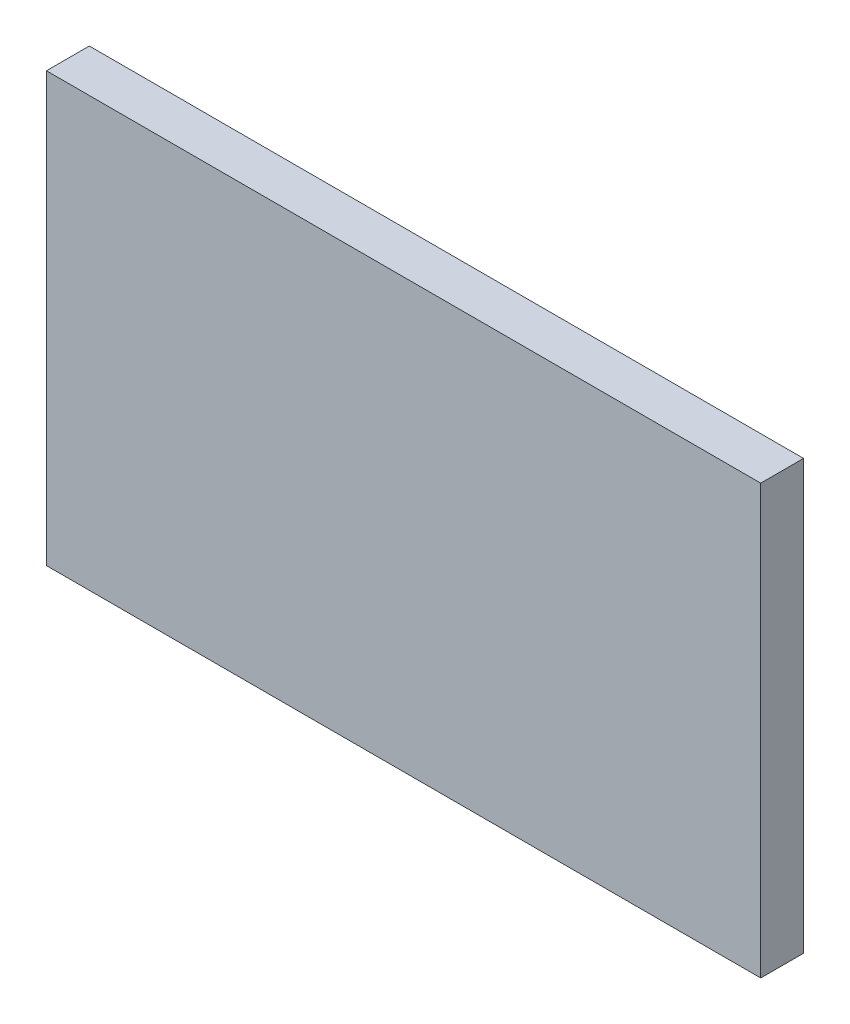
from build123d import *

# Parameters (mm, degrees)
SKETCH1_W      = 50
SKETCH1_H      = 30
EXTRUDE1_DEPTH = 3


with BuildPart() as part:
    # Sketch1 → Extrude1 (new body)
    with BuildSketch(Plane.XY):
        with Locations((25, 15)):
            Rectangle(SKETCH1_W, SKETCH1_H)
    extrude(amount=EXTRUDE1_DEPTH)


solid = part.part
